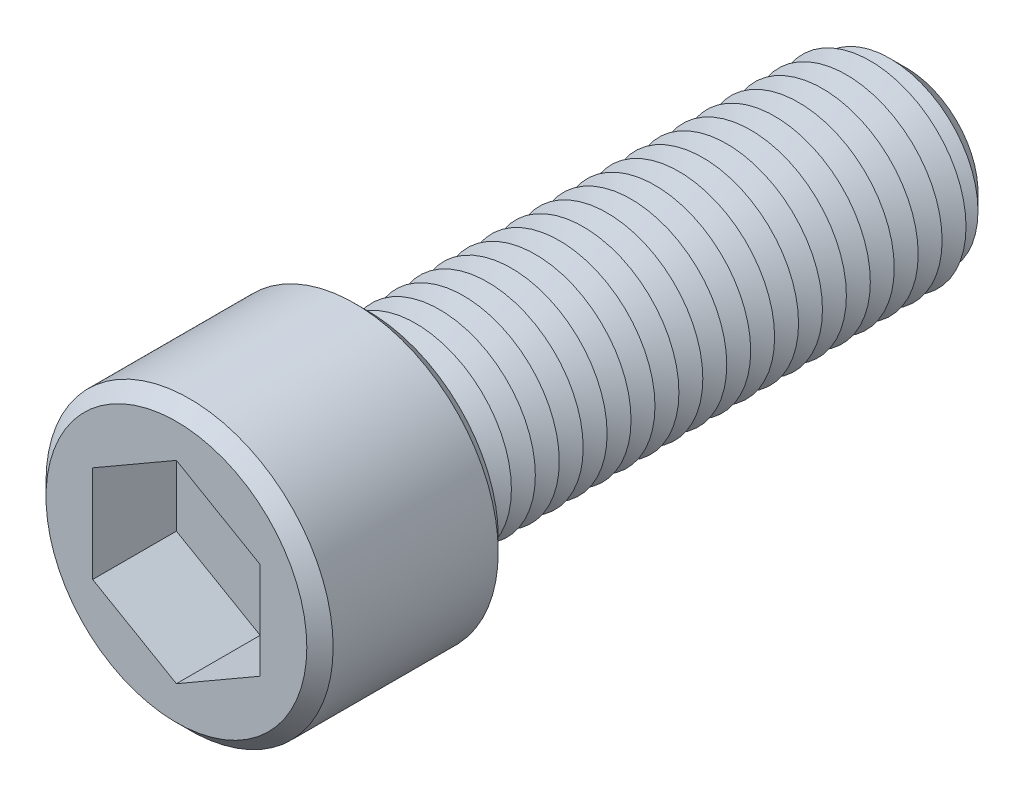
ISO-10303-21;
HEADER;
FILE_DESCRIPTION(('STEP AP214'),'2;1');
FILE_NAME('part.step','',(''),(''),'','','');
FILE_SCHEMA(('AUTOMOTIVE_DESIGN { 1 0 10303 214 1 1 1 1 }'));
ENDSEC;
DATA;
#1=APPLICATION_CONTEXT('core data for automotive mechanical design processes');
#2=APPLICATION_PROTOCOL_DEFINITION('international standard','automotive_design',2000,#1);
#3=PRODUCT_CONTEXT('',#1,'mechanical');
#4=PRODUCT('Part','Part','',(#3));
#5=PRODUCT_RELATED_PRODUCT_CATEGORY('part','',(#4));
#6=PRODUCT_DEFINITION_FORMATION('','',#4);
#7=PRODUCT_DEFINITION_CONTEXT('part definition',#1,'design');
#8=PRODUCT_DEFINITION('design','',#6,#7);
#9=PRODUCT_DEFINITION_SHAPE('','',#8);
#10=(LENGTH_UNIT() NAMED_UNIT(*) SI_UNIT(.MILLI.,.METRE.));
#11=(NAMED_UNIT(*) PLANE_ANGLE_UNIT() SI_UNIT($,.RADIAN.));
#12=(NAMED_UNIT(*) SI_UNIT($,.STERADIAN.) SOLID_ANGLE_UNIT());
#13=UNCERTAINTY_MEASURE_WITH_UNIT(LENGTH_MEASURE(1.E-05),#10,'distance_accuracy_value','');
#14=(GEOMETRIC_REPRESENTATION_CONTEXT(3) GLOBAL_UNCERTAINTY_ASSIGNED_CONTEXT((#13)) GLOBAL_UNIT_ASSIGNED_CONTEXT((#10,
#11,#12)) REPRESENTATION_CONTEXT('',''));
#15=CARTESIAN_POINT('',(0.,0.,0.));
#16=DIRECTION('',(0.,0.,1.));
#17=DIRECTION('',(1.,0.,0.));
#18=AXIS2_PLACEMENT_3D('',#15,#16,#17);
#19=CARTESIAN_POINT('',(0.,0.,16.));
#20=DIRECTION('',(0.,0.,-1.));
#21=DIRECTION('',(-1.,0.,0.));
#22=AXIS2_PLACEMENT_3D('',#19,#20,#21);
#23=CYLINDRICAL_SURFACE('',#22,12.);
#24=CARTESIAN_POINT('',(0.,0.,1.10000000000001));
#25=DIRECTION('',(0.,0.,1.));
#26=DIRECTION('',(1.,0.,0.));
#27=AXIS2_PLACEMENT_3D('',#24,#25,#26);
#28=CIRCLE('',#27,12.);
#29=CARTESIAN_POINT('',(12.,0.,1.10000000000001));
#30=VERTEX_POINT('',#29);
#31=EDGE_CURVE('E352',#30,#30,#28,.T.);
#32=ORIENTED_EDGE('',*,*,#31,.T.);
#33=EDGE_LOOP('',(#32));
#34=FACE_BOUND('',#33,.T.);
#35=CARTESIAN_POINT('',(0.,0.,14.9));
#36=DIRECTION('',(0.,0.,1.));
#37=DIRECTION('',(1.,0.,0.));
#38=AXIS2_PLACEMENT_3D('',#35,#36,#37);
#39=CIRCLE('',#38,12.);
#40=CARTESIAN_POINT('',(12.,0.,14.9));
#41=VERTEX_POINT('',#40);
#42=EDGE_CURVE('E345',#41,#41,#39,.F.);
#43=ORIENTED_EDGE('',*,*,#42,.T.);
#44=EDGE_LOOP('',(#43));
#45=FACE_BOUND('',#44,.T.);
#46=ADVANCED_FACE('F39',(#34,#45),#23,.T.);
#47=CARTESIAN_POINT('',(0.,0.,16.));
#48=DIRECTION('',(0.,0.,1.));
#49=DIRECTION('',(1.,0.,0.));
#50=AXIS2_PLACEMENT_3D('',#47,#48,#49);
#51=PLANE('',#50);
#52=CARTESIAN_POINT('',(0.,0.,16.));
#53=DIRECTION('',(0.,0.,1.));
#54=DIRECTION('',(1.,0.,0.));
#55=AXIS2_PLACEMENT_3D('',#52,#53,#54);
#56=CIRCLE('',#55,10.9);
#57=CARTESIAN_POINT('',(10.9,0.,16.));
#58=VERTEX_POINT('',#57);
#59=EDGE_CURVE('E11',#58,#58,#56,.T.);
#60=ORIENTED_EDGE('',*,*,#59,.T.);
#61=EDGE_LOOP('',(#60));
#62=FACE_BOUND('',#61,.T.);
#63=DIRECTION('',(-0.866025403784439,0.5,0.));
#64=VECTOR('',#63,1.);
#65=CARTESIAN_POINT('',(7.,4.04145188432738,16.));
#66=LINE('',#65,#64);
#67=CARTESIAN_POINT('',(7.,4.04145188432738,16.));
#68=VERTEX_POINT('',#67);
#69=CARTESIAN_POINT('',(0.,8.08290376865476,16.));
#70=VERTEX_POINT('',#69);
#71=EDGE_CURVE('E55',#68,#70,#66,.T.);
#72=ORIENTED_EDGE('',*,*,#71,.F.);
#73=DIRECTION('',(0.,1.,0.));
#74=VECTOR('',#73,1.);
#75=CARTESIAN_POINT('',(7.,-4.04145188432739,16.));
#76=LINE('',#75,#74);
#77=CARTESIAN_POINT('',(7.,-4.04145188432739,16.));
#78=VERTEX_POINT('',#77);
#79=EDGE_CURVE('E151',#78,#68,#76,.T.);
#80=ORIENTED_EDGE('',*,*,#79,.F.);
#81=DIRECTION('',(0.866025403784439,0.5,0.));
#82=VECTOR('',#81,1.);
#83=CARTESIAN_POINT('',(0.,-8.08290376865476,16.));
#84=LINE('',#83,#82);
#85=CARTESIAN_POINT('',(0.,-8.08290376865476,16.));
#86=VERTEX_POINT('',#85);
#87=EDGE_CURVE('E148',#86,#78,#84,.T.);
#88=ORIENTED_EDGE('',*,*,#87,.F.);
#89=DIRECTION('',(0.866025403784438,-0.5,0.));
#90=VECTOR('',#89,1.);
#91=CARTESIAN_POINT('',(-7.,-4.04145188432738,16.));
#92=LINE('',#91,#90);
#93=CARTESIAN_POINT('',(-7.,-4.04145188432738,16.));
#94=VERTEX_POINT('',#93);
#95=EDGE_CURVE('E103',#94,#86,#92,.T.);
#96=ORIENTED_EDGE('',*,*,#95,.F.);
#97=DIRECTION('',(0.,-1.,0.));
#98=VECTOR('',#97,1.);
#99=CARTESIAN_POINT('',(-7.,4.04145188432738,16.));
#100=LINE('',#99,#98);
#101=CARTESIAN_POINT('',(-7.,4.04145188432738,16.));
#102=VERTEX_POINT('',#101);
#103=EDGE_CURVE('E142',#102,#94,#100,.T.);
#104=ORIENTED_EDGE('',*,*,#103,.F.);
#105=DIRECTION('',(-0.866025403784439,-0.5,0.));
#106=VECTOR('',#105,1.);
#107=CARTESIAN_POINT('',(0.,8.08290376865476,16.));
#108=LINE('',#107,#106);
#109=EDGE_CURVE('E137',#70,#102,#108,.T.);
#110=ORIENTED_EDGE('',*,*,#109,.F.);
#111=EDGE_LOOP('',(#72,#80,#88,#96,#104,#110));
#112=FACE_BOUND('',#111,.T.);
#113=ADVANCED_FACE('F370',(#62,#112),#51,.T.);
#114=CARTESIAN_POINT('',(0.,0.,0.));
#115=DIRECTION('',(0.,0.,1.));
#116=DIRECTION('',(1.,0.,0.));
#117=AXIS2_PLACEMENT_3D('',#114,#115,#116);
#118=PLANE('',#117);
#119=CARTESIAN_POINT('',(0.,0.,0.));
#120=DIRECTION('',(0.,0.,1.));
#121=DIRECTION('',(1.,0.,0.));
#122=AXIS2_PLACEMENT_3D('',#119,#120,#121);
#123=CIRCLE('',#122,10.9);
#124=CARTESIAN_POINT('',(10.9,0.,0.));
#125=VERTEX_POINT('',#124);
#126=EDGE_CURVE('E48',#125,#125,#123,.F.);
#127=ORIENTED_EDGE('',*,*,#126,.T.);
#128=EDGE_LOOP('',(#127));
#129=FACE_BOUND('',#128,.T.);
#130=CARTESIAN_POINT('',(0.,0.,0.));
#131=DIRECTION('',(0.,0.,1.));
#132=DIRECTION('',(1.,0.,0.));
#133=AXIS2_PLACEMENT_3D('',#130,#131,#132);
#134=CIRCLE('',#133,8.);
#135=CARTESIAN_POINT('',(8.,0.,0.));
#136=VERTEX_POINT('',#135);
#137=EDGE_CURVE('E337',#136,#136,#134,.T.);
#138=ORIENTED_EDGE('',*,*,#137,.T.);
#139=EDGE_LOOP('',(#138));
#140=FACE_BOUND('',#139,.T.);
#141=ADVANCED_FACE('F359',(#129,#140),#118,.F.);
#142=CARTESIAN_POINT('',(0.,0.,0.));
#143=DIRECTION('',(0.,0.,1.));
#144=DIRECTION('',(1.,0.,0.));
#145=AXIS2_PLACEMENT_3D('',#142,#143,#144);
#146=CONICAL_SURFACE('',#145,8.,1.0471975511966);
#147=CARTESIAN_POINT('',(0.,0.,-1.));
#148=DIRECTION('',(0.,0.,1.));
#149=DIRECTION('',(1.,0.,0.));
#150=AXIS2_PLACEMENT_3D('',#147,#148,#149);
#151=CIRCLE('',#150,6.26794919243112);
#152=CARTESIAN_POINT('',(6.26794919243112,0.,-1.));
#153=VERTEX_POINT('',#152);
#154=EDGE_CURVE('E333',#153,#153,#151,.T.);
#155=ORIENTED_EDGE('',*,*,#154,.T.);
#156=EDGE_LOOP('',(#155));
#157=FACE_BOUND('',#156,.T.);
#158=ORIENTED_EDGE('',*,*,#137,.F.);
#159=EDGE_LOOP('',(#158));
#160=FACE_BOUND('',#159,.T.);
#161=ADVANCED_FACE('F596',(#157,#160),#146,.T.);
#162=CARTESIAN_POINT('',(0.,0.,-1.));
#163=DIRECTION('',(0.,0.,-1.));
#164=DIRECTION('',(-1.,0.,0.));
#165=AXIS2_PLACEMENT_3D('',#162,#163,#164);
#166=CONICAL_SURFACE('',#165,6.26794919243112,1.0471975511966);
#167=CARTESIAN_POINT('',(0.,0.,-2.));
#168=DIRECTION('',(0.,0.,1.));
#169=DIRECTION('',(1.,0.,0.));
#170=AXIS2_PLACEMENT_3D('',#167,#168,#169);
#171=CIRCLE('',#170,8.);
#172=CARTESIAN_POINT('',(8.,0.,-2.));
#173=VERTEX_POINT('',#172);
#174=EDGE_CURVE('E329',#173,#173,#171,.T.);
#175=ORIENTED_EDGE('',*,*,#174,.T.);
#176=EDGE_LOOP('',(#175));
#177=FACE_BOUND('',#176,.T.);
#178=ORIENTED_EDGE('',*,*,#154,.F.);
#179=EDGE_LOOP('',(#178));
#180=FACE_BOUND('',#179,.T.);
#181=ADVANCED_FACE('F592',(#177,#180),#166,.T.);
#182=CARTESIAN_POINT('',(0.,0.,-2.));
#183=DIRECTION('',(0.,0.,1.));
#184=DIRECTION('',(1.,0.,0.));
#185=AXIS2_PLACEMENT_3D('',#182,#183,#184);
#186=CONICAL_SURFACE('',#185,8.,1.0471975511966);
#187=CARTESIAN_POINT('',(0.,0.,-3.));
#188=DIRECTION('',(0.,0.,1.));
#189=DIRECTION('',(1.,0.,0.));
#190=AXIS2_PLACEMENT_3D('',#187,#188,#189);
#191=CIRCLE('',#190,6.26794919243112);
#192=CARTESIAN_POINT('',(6.26794919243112,0.,-3.));
#193=VERTEX_POINT('',#192);
#194=EDGE_CURVE('E325',#193,#193,#191,.T.);
#195=ORIENTED_EDGE('',*,*,#194,.T.);
#196=EDGE_LOOP('',(#195));
#197=FACE_BOUND('',#196,.T.);
#198=ORIENTED_EDGE('',*,*,#174,.F.);
#199=EDGE_LOOP('',(#198));
#200=FACE_BOUND('',#199,.T.);
#201=ADVANCED_FACE('F588',(#197,#200),#186,.T.);
#202=CARTESIAN_POINT('',(0.,0.,-3.));
#203=DIRECTION('',(0.,0.,-1.));
#204=DIRECTION('',(-1.,0.,0.));
#205=AXIS2_PLACEMENT_3D('',#202,#203,#204);
#206=CONICAL_SURFACE('',#205,6.26794919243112,1.0471975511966);
#207=CARTESIAN_POINT('',(0.,0.,-4.));
#208=DIRECTION('',(0.,0.,1.));
#209=DIRECTION('',(1.,0.,0.));
#210=AXIS2_PLACEMENT_3D('',#207,#208,#209);
#211=CIRCLE('',#210,8.);
#212=CARTESIAN_POINT('',(8.,0.,-4.));
#213=VERTEX_POINT('',#212);
#214=EDGE_CURVE('E322',#213,#213,#211,.T.);
#215=ORIENTED_EDGE('',*,*,#214,.T.);
#216=EDGE_LOOP('',(#215));
#217=FACE_BOUND('',#216,.T.);
#218=ORIENTED_EDGE('',*,*,#194,.F.);
#219=EDGE_LOOP('',(#218));
#220=FACE_BOUND('',#219,.T.);
#221=ADVANCED_FACE('F584',(#217,#220),#206,.T.);
#222=CARTESIAN_POINT('',(0.,0.,-4.));
#223=DIRECTION('',(0.,0.,1.));
#224=DIRECTION('',(1.,0.,0.));
#225=AXIS2_PLACEMENT_3D('',#222,#223,#224);
#226=CONICAL_SURFACE('',#225,8.,1.0471975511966);
#227=CARTESIAN_POINT('',(0.,0.,-5.));
#228=DIRECTION('',(0.,0.,1.));
#229=DIRECTION('',(1.,0.,0.));
#230=AXIS2_PLACEMENT_3D('',#227,#228,#229);
#231=CIRCLE('',#230,6.26794919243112);
#232=CARTESIAN_POINT('',(6.26794919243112,0.,-5.));
#233=VERTEX_POINT('',#232);
#234=EDGE_CURVE('E318',#233,#233,#231,.T.);
#235=ORIENTED_EDGE('',*,*,#234,.T.);
#236=EDGE_LOOP('',(#235));
#237=FACE_BOUND('',#236,.T.);
#238=ORIENTED_EDGE('',*,*,#214,.F.);
#239=EDGE_LOOP('',(#238));
#240=FACE_BOUND('',#239,.T.);
#241=ADVANCED_FACE('F580',(#237,#240),#226,.T.);
#242=CARTESIAN_POINT('',(0.,0.,-5.));
#243=DIRECTION('',(0.,0.,-1.));
#244=DIRECTION('',(-1.,0.,0.));
#245=AXIS2_PLACEMENT_3D('',#242,#243,#244);
#246=CONICAL_SURFACE('',#245,6.26794919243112,1.0471975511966);
#247=CARTESIAN_POINT('',(0.,0.,-6.));
#248=DIRECTION('',(0.,0.,1.));
#249=DIRECTION('',(1.,0.,0.));
#250=AXIS2_PLACEMENT_3D('',#247,#248,#249);
#251=CIRCLE('',#250,8.);
#252=CARTESIAN_POINT('',(8.,0.,-6.));
#253=VERTEX_POINT('',#252);
#254=EDGE_CURVE('E314',#253,#253,#251,.T.);
#255=ORIENTED_EDGE('',*,*,#254,.T.);
#256=EDGE_LOOP('',(#255));
#257=FACE_BOUND('',#256,.T.);
#258=ORIENTED_EDGE('',*,*,#234,.F.);
#259=EDGE_LOOP('',(#258));
#260=FACE_BOUND('',#259,.T.);
#261=ADVANCED_FACE('F576',(#257,#260),#246,.T.);
#262=CARTESIAN_POINT('',(0.,0.,-6.));
#263=DIRECTION('',(0.,0.,1.));
#264=DIRECTION('',(1.,0.,0.));
#265=AXIS2_PLACEMENT_3D('',#262,#263,#264);
#266=CONICAL_SURFACE('',#265,8.,1.0471975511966);
#267=CARTESIAN_POINT('',(0.,0.,-7.));
#268=DIRECTION('',(0.,0.,1.));
#269=DIRECTION('',(1.,0.,0.));
#270=AXIS2_PLACEMENT_3D('',#267,#268,#269);
#271=CIRCLE('',#270,6.26794919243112);
#272=CARTESIAN_POINT('',(6.26794919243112,0.,-7.));
#273=VERTEX_POINT('',#272);
#274=EDGE_CURVE('E310',#273,#273,#271,.T.);
#275=ORIENTED_EDGE('',*,*,#274,.T.);
#276=EDGE_LOOP('',(#275));
#277=FACE_BOUND('',#276,.T.);
#278=ORIENTED_EDGE('',*,*,#254,.F.);
#279=EDGE_LOOP('',(#278));
#280=FACE_BOUND('',#279,.T.);
#281=ADVANCED_FACE('F572',(#277,#280),#266,.T.);
#282=CARTESIAN_POINT('',(0.,0.,-7.));
#283=DIRECTION('',(0.,0.,-1.));
#284=DIRECTION('',(-1.,0.,0.));
#285=AXIS2_PLACEMENT_3D('',#282,#283,#284);
#286=CONICAL_SURFACE('',#285,6.26794919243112,1.0471975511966);
#287=CARTESIAN_POINT('',(0.,0.,-8.));
#288=DIRECTION('',(0.,0.,1.));
#289=DIRECTION('',(1.,0.,0.));
#290=AXIS2_PLACEMENT_3D('',#287,#288,#289);
#291=CIRCLE('',#290,8.);
#292=CARTESIAN_POINT('',(8.,0.,-8.));
#293=VERTEX_POINT('',#292);
#294=EDGE_CURVE('E306',#293,#293,#291,.T.);
#295=ORIENTED_EDGE('',*,*,#294,.T.);
#296=EDGE_LOOP('',(#295));
#297=FACE_BOUND('',#296,.T.);
#298=ORIENTED_EDGE('',*,*,#274,.F.);
#299=EDGE_LOOP('',(#298));
#300=FACE_BOUND('',#299,.T.);
#301=ADVANCED_FACE('F568',(#297,#300),#286,.T.);
#302=CARTESIAN_POINT('',(0.,0.,-8.));
#303=DIRECTION('',(0.,0.,1.));
#304=DIRECTION('',(1.,0.,0.));
#305=AXIS2_PLACEMENT_3D('',#302,#303,#304);
#306=CONICAL_SURFACE('',#305,8.,1.0471975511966);
#307=CARTESIAN_POINT('',(0.,0.,-9.));
#308=DIRECTION('',(0.,0.,1.));
#309=DIRECTION('',(1.,0.,0.));
#310=AXIS2_PLACEMENT_3D('',#307,#308,#309);
#311=CIRCLE('',#310,6.26794919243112);
#312=CARTESIAN_POINT('',(6.26794919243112,0.,-9.));
#313=VERTEX_POINT('',#312);
#314=EDGE_CURVE('E302',#313,#313,#311,.T.);
#315=ORIENTED_EDGE('',*,*,#314,.T.);
#316=EDGE_LOOP('',(#315));
#317=FACE_BOUND('',#316,.T.);
#318=ORIENTED_EDGE('',*,*,#294,.F.);
#319=EDGE_LOOP('',(#318));
#320=FACE_BOUND('',#319,.T.);
#321=ADVANCED_FACE('F564',(#317,#320),#306,.T.);
#322=CARTESIAN_POINT('',(0.,0.,-9.));
#323=DIRECTION('',(0.,0.,-1.));
#324=DIRECTION('',(-1.,0.,0.));
#325=AXIS2_PLACEMENT_3D('',#322,#323,#324);
#326=CONICAL_SURFACE('',#325,6.26794919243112,1.0471975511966);
#327=CARTESIAN_POINT('',(0.,0.,-10.));
#328=DIRECTION('',(0.,0.,1.));
#329=DIRECTION('',(1.,0.,0.));
#330=AXIS2_PLACEMENT_3D('',#327,#328,#329);
#331=CIRCLE('',#330,8.);
#332=CARTESIAN_POINT('',(8.,0.,-10.));
#333=VERTEX_POINT('',#332);
#334=EDGE_CURVE('E298',#333,#333,#331,.T.);
#335=ORIENTED_EDGE('',*,*,#334,.T.);
#336=EDGE_LOOP('',(#335));
#337=FACE_BOUND('',#336,.T.);
#338=ORIENTED_EDGE('',*,*,#314,.F.);
#339=EDGE_LOOP('',(#338));
#340=FACE_BOUND('',#339,.T.);
#341=ADVANCED_FACE('F560',(#337,#340),#326,.T.);
#342=CARTESIAN_POINT('',(0.,0.,-10.));
#343=DIRECTION('',(0.,0.,1.));
#344=DIRECTION('',(1.,0.,0.));
#345=AXIS2_PLACEMENT_3D('',#342,#343,#344);
#346=CONICAL_SURFACE('',#345,8.,1.0471975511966);
#347=CARTESIAN_POINT('',(0.,0.,-11.));
#348=DIRECTION('',(0.,0.,1.));
#349=DIRECTION('',(1.,0.,0.));
#350=AXIS2_PLACEMENT_3D('',#347,#348,#349);
#351=CIRCLE('',#350,6.26794919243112);
#352=CARTESIAN_POINT('',(6.26794919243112,0.,-11.));
#353=VERTEX_POINT('',#352);
#354=EDGE_CURVE('E294',#353,#353,#351,.T.);
#355=ORIENTED_EDGE('',*,*,#354,.T.);
#356=EDGE_LOOP('',(#355));
#357=FACE_BOUND('',#356,.T.);
#358=ORIENTED_EDGE('',*,*,#334,.F.);
#359=EDGE_LOOP('',(#358));
#360=FACE_BOUND('',#359,.T.);
#361=ADVANCED_FACE('F556',(#357,#360),#346,.T.);
#362=CARTESIAN_POINT('',(0.,0.,-11.));
#363=DIRECTION('',(0.,0.,-1.));
#364=DIRECTION('',(-1.,0.,0.));
#365=AXIS2_PLACEMENT_3D('',#362,#363,#364);
#366=CONICAL_SURFACE('',#365,6.26794919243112,1.0471975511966);
#367=CARTESIAN_POINT('',(0.,0.,-12.));
#368=DIRECTION('',(0.,0.,1.));
#369=DIRECTION('',(1.,0.,0.));
#370=AXIS2_PLACEMENT_3D('',#367,#368,#369);
#371=CIRCLE('',#370,8.);
#372=CARTESIAN_POINT('',(8.,0.,-12.));
#373=VERTEX_POINT('',#372);
#374=EDGE_CURVE('E290',#373,#373,#371,.T.);
#375=ORIENTED_EDGE('',*,*,#374,.T.);
#376=EDGE_LOOP('',(#375));
#377=FACE_BOUND('',#376,.T.);
#378=ORIENTED_EDGE('',*,*,#354,.F.);
#379=EDGE_LOOP('',(#378));
#380=FACE_BOUND('',#379,.T.);
#381=ADVANCED_FACE('F552',(#377,#380),#366,.T.);
#382=CARTESIAN_POINT('',(0.,0.,-12.));
#383=DIRECTION('',(0.,0.,1.));
#384=DIRECTION('',(1.,0.,0.));
#385=AXIS2_PLACEMENT_3D('',#382,#383,#384);
#386=CONICAL_SURFACE('',#385,8.,1.0471975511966);
#387=CARTESIAN_POINT('',(0.,0.,-13.));
#388=DIRECTION('',(0.,0.,1.));
#389=DIRECTION('',(1.,0.,0.));
#390=AXIS2_PLACEMENT_3D('',#387,#388,#389);
#391=CIRCLE('',#390,6.26794919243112);
#392=CARTESIAN_POINT('',(6.26794919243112,0.,-13.));
#393=VERTEX_POINT('',#392);
#394=EDGE_CURVE('E286',#393,#393,#391,.T.);
#395=ORIENTED_EDGE('',*,*,#394,.T.);
#396=EDGE_LOOP('',(#395));
#397=FACE_BOUND('',#396,.T.);
#398=ORIENTED_EDGE('',*,*,#374,.F.);
#399=EDGE_LOOP('',(#398));
#400=FACE_BOUND('',#399,.T.);
#401=ADVANCED_FACE('F548',(#397,#400),#386,.T.);
#402=CARTESIAN_POINT('',(0.,0.,-13.));
#403=DIRECTION('',(0.,0.,-1.));
#404=DIRECTION('',(-1.,0.,0.));
#405=AXIS2_PLACEMENT_3D('',#402,#403,#404);
#406=CONICAL_SURFACE('',#405,6.26794919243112,1.0471975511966);
#407=CARTESIAN_POINT('',(0.,0.,-14.));
#408=DIRECTION('',(0.,0.,1.));
#409=DIRECTION('',(1.,0.,0.));
#410=AXIS2_PLACEMENT_3D('',#407,#408,#409);
#411=CIRCLE('',#410,8.);
#412=CARTESIAN_POINT('',(8.,0.,-14.));
#413=VERTEX_POINT('',#412);
#414=EDGE_CURVE('E282',#413,#413,#411,.T.);
#415=ORIENTED_EDGE('',*,*,#414,.T.);
#416=EDGE_LOOP('',(#415));
#417=FACE_BOUND('',#416,.T.);
#418=ORIENTED_EDGE('',*,*,#394,.F.);
#419=EDGE_LOOP('',(#418));
#420=FACE_BOUND('',#419,.T.);
#421=ADVANCED_FACE('F544',(#417,#420),#406,.T.);
#422=CARTESIAN_POINT('',(0.,0.,-14.));
#423=DIRECTION('',(0.,0.,1.));
#424=DIRECTION('',(1.,0.,0.));
#425=AXIS2_PLACEMENT_3D('',#422,#423,#424);
#426=CONICAL_SURFACE('',#425,8.,1.0471975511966);
#427=CARTESIAN_POINT('',(0.,0.,-15.));
#428=DIRECTION('',(0.,0.,1.));
#429=DIRECTION('',(1.,0.,0.));
#430=AXIS2_PLACEMENT_3D('',#427,#428,#429);
#431=CIRCLE('',#430,6.26794919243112);
#432=CARTESIAN_POINT('',(6.26794919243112,0.,-15.));
#433=VERTEX_POINT('',#432);
#434=EDGE_CURVE('E278',#433,#433,#431,.T.);
#435=ORIENTED_EDGE('',*,*,#434,.T.);
#436=EDGE_LOOP('',(#435));
#437=FACE_BOUND('',#436,.T.);
#438=ORIENTED_EDGE('',*,*,#414,.F.);
#439=EDGE_LOOP('',(#438));
#440=FACE_BOUND('',#439,.T.);
#441=ADVANCED_FACE('F540',(#437,#440),#426,.T.);
#442=CARTESIAN_POINT('',(0.,0.,-15.));
#443=DIRECTION('',(0.,0.,-1.));
#444=DIRECTION('',(-1.,0.,0.));
#445=AXIS2_PLACEMENT_3D('',#442,#443,#444);
#446=CONICAL_SURFACE('',#445,6.26794919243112,1.0471975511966);
#447=CARTESIAN_POINT('',(0.,0.,-16.));
#448=DIRECTION('',(0.,0.,1.));
#449=DIRECTION('',(1.,0.,0.));
#450=AXIS2_PLACEMENT_3D('',#447,#448,#449);
#451=CIRCLE('',#450,8.);
#452=CARTESIAN_POINT('',(8.,0.,-16.));
#453=VERTEX_POINT('',#452);
#454=EDGE_CURVE('E274',#453,#453,#451,.T.);
#455=ORIENTED_EDGE('',*,*,#454,.T.);
#456=EDGE_LOOP('',(#455));
#457=FACE_BOUND('',#456,.T.);
#458=ORIENTED_EDGE('',*,*,#434,.F.);
#459=EDGE_LOOP('',(#458));
#460=FACE_BOUND('',#459,.T.);
#461=ADVANCED_FACE('F536',(#457,#460),#446,.T.);
#462=CARTESIAN_POINT('',(0.,0.,-16.));
#463=DIRECTION('',(0.,0.,1.));
#464=DIRECTION('',(1.,0.,0.));
#465=AXIS2_PLACEMENT_3D('',#462,#463,#464);
#466=CONICAL_SURFACE('',#465,8.,1.0471975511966);
#467=CARTESIAN_POINT('',(0.,0.,-17.));
#468=DIRECTION('',(0.,0.,1.));
#469=DIRECTION('',(1.,0.,0.));
#470=AXIS2_PLACEMENT_3D('',#467,#468,#469);
#471=CIRCLE('',#470,6.26794919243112);
#472=CARTESIAN_POINT('',(6.26794919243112,0.,-17.));
#473=VERTEX_POINT('',#472);
#474=EDGE_CURVE('E270',#473,#473,#471,.T.);
#475=ORIENTED_EDGE('',*,*,#474,.T.);
#476=EDGE_LOOP('',(#475));
#477=FACE_BOUND('',#476,.T.);
#478=ORIENTED_EDGE('',*,*,#454,.F.);
#479=EDGE_LOOP('',(#478));
#480=FACE_BOUND('',#479,.T.);
#481=ADVANCED_FACE('F532',(#477,#480),#466,.T.);
#482=CARTESIAN_POINT('',(0.,0.,-17.));
#483=DIRECTION('',(0.,0.,-1.));
#484=DIRECTION('',(-1.,0.,0.));
#485=AXIS2_PLACEMENT_3D('',#482,#483,#484);
#486=CONICAL_SURFACE('',#485,6.26794919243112,1.0471975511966);
#487=CARTESIAN_POINT('',(0.,0.,-18.));
#488=DIRECTION('',(0.,0.,1.));
#489=DIRECTION('',(1.,0.,0.));
#490=AXIS2_PLACEMENT_3D('',#487,#488,#489);
#491=CIRCLE('',#490,8.);
#492=CARTESIAN_POINT('',(8.,0.,-18.));
#493=VERTEX_POINT('',#492);
#494=EDGE_CURVE('E266',#493,#493,#491,.T.);
#495=ORIENTED_EDGE('',*,*,#494,.T.);
#496=EDGE_LOOP('',(#495));
#497=FACE_BOUND('',#496,.T.);
#498=ORIENTED_EDGE('',*,*,#474,.F.);
#499=EDGE_LOOP('',(#498));
#500=FACE_BOUND('',#499,.T.);
#501=ADVANCED_FACE('F528',(#497,#500),#486,.T.);
#502=CARTESIAN_POINT('',(0.,0.,-18.));
#503=DIRECTION('',(0.,0.,1.));
#504=DIRECTION('',(1.,0.,0.));
#505=AXIS2_PLACEMENT_3D('',#502,#503,#504);
#506=CONICAL_SURFACE('',#505,8.,1.0471975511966);
#507=CARTESIAN_POINT('',(0.,0.,-19.));
#508=DIRECTION('',(0.,0.,1.));
#509=DIRECTION('',(1.,0.,0.));
#510=AXIS2_PLACEMENT_3D('',#507,#508,#509);
#511=CIRCLE('',#510,6.26794919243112);
#512=CARTESIAN_POINT('',(6.26794919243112,0.,-19.));
#513=VERTEX_POINT('',#512);
#514=EDGE_CURVE('E262',#513,#513,#511,.T.);
#515=ORIENTED_EDGE('',*,*,#514,.T.);
#516=EDGE_LOOP('',(#515));
#517=FACE_BOUND('',#516,.T.);
#518=ORIENTED_EDGE('',*,*,#494,.F.);
#519=EDGE_LOOP('',(#518));
#520=FACE_BOUND('',#519,.T.);
#521=ADVANCED_FACE('F524',(#517,#520),#506,.T.);
#522=CARTESIAN_POINT('',(0.,0.,-19.));
#523=DIRECTION('',(0.,0.,-1.));
#524=DIRECTION('',(-1.,0.,0.));
#525=AXIS2_PLACEMENT_3D('',#522,#523,#524);
#526=CONICAL_SURFACE('',#525,6.26794919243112,1.0471975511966);
#527=CARTESIAN_POINT('',(0.,0.,-20.));
#528=DIRECTION('',(0.,0.,1.));
#529=DIRECTION('',(1.,0.,0.));
#530=AXIS2_PLACEMENT_3D('',#527,#528,#529);
#531=CIRCLE('',#530,8.);
#532=CARTESIAN_POINT('',(8.,0.,-20.));
#533=VERTEX_POINT('',#532);
#534=EDGE_CURVE('E258',#533,#533,#531,.T.);
#535=ORIENTED_EDGE('',*,*,#534,.T.);
#536=EDGE_LOOP('',(#535));
#537=FACE_BOUND('',#536,.T.);
#538=ORIENTED_EDGE('',*,*,#514,.F.);
#539=EDGE_LOOP('',(#538));
#540=FACE_BOUND('',#539,.T.);
#541=ADVANCED_FACE('F520',(#537,#540),#526,.T.);
#542=CARTESIAN_POINT('',(0.,0.,-20.));
#543=DIRECTION('',(0.,0.,1.));
#544=DIRECTION('',(1.,0.,0.));
#545=AXIS2_PLACEMENT_3D('',#542,#543,#544);
#546=CONICAL_SURFACE('',#545,8.,1.0471975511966);
#547=CARTESIAN_POINT('',(0.,0.,-21.));
#548=DIRECTION('',(0.,0.,1.));
#549=DIRECTION('',(1.,0.,0.));
#550=AXIS2_PLACEMENT_3D('',#547,#548,#549);
#551=CIRCLE('',#550,6.26794919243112);
#552=CARTESIAN_POINT('',(6.26794919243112,0.,-21.));
#553=VERTEX_POINT('',#552);
#554=EDGE_CURVE('E254',#553,#553,#551,.T.);
#555=ORIENTED_EDGE('',*,*,#554,.T.);
#556=EDGE_LOOP('',(#555));
#557=FACE_BOUND('',#556,.T.);
#558=ORIENTED_EDGE('',*,*,#534,.F.);
#559=EDGE_LOOP('',(#558));
#560=FACE_BOUND('',#559,.T.);
#561=ADVANCED_FACE('F516',(#557,#560),#546,.T.);
#562=CARTESIAN_POINT('',(0.,0.,-21.));
#563=DIRECTION('',(0.,0.,-1.));
#564=DIRECTION('',(-1.,0.,0.));
#565=AXIS2_PLACEMENT_3D('',#562,#563,#564);
#566=CONICAL_SURFACE('',#565,6.26794919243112,1.0471975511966);
#567=CARTESIAN_POINT('',(0.,0.,-22.));
#568=DIRECTION('',(0.,0.,1.));
#569=DIRECTION('',(1.,0.,0.));
#570=AXIS2_PLACEMENT_3D('',#567,#568,#569);
#571=CIRCLE('',#570,8.);
#572=CARTESIAN_POINT('',(8.,0.,-22.));
#573=VERTEX_POINT('',#572);
#574=EDGE_CURVE('E250',#573,#573,#571,.T.);
#575=ORIENTED_EDGE('',*,*,#574,.T.);
#576=EDGE_LOOP('',(#575));
#577=FACE_BOUND('',#576,.T.);
#578=ORIENTED_EDGE('',*,*,#554,.F.);
#579=EDGE_LOOP('',(#578));
#580=FACE_BOUND('',#579,.T.);
#581=ADVANCED_FACE('F512',(#577,#580),#566,.T.);
#582=CARTESIAN_POINT('',(0.,0.,-22.));
#583=DIRECTION('',(0.,0.,1.));
#584=DIRECTION('',(1.,0.,0.));
#585=AXIS2_PLACEMENT_3D('',#582,#583,#584);
#586=CONICAL_SURFACE('',#585,8.,1.0471975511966);
#587=CARTESIAN_POINT('',(0.,0.,-23.));
#588=DIRECTION('',(0.,0.,1.));
#589=DIRECTION('',(1.,0.,0.));
#590=AXIS2_PLACEMENT_3D('',#587,#588,#589);
#591=CIRCLE('',#590,6.26794919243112);
#592=CARTESIAN_POINT('',(6.26794919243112,0.,-23.));
#593=VERTEX_POINT('',#592);
#594=EDGE_CURVE('E246',#593,#593,#591,.T.);
#595=ORIENTED_EDGE('',*,*,#594,.T.);
#596=EDGE_LOOP('',(#595));
#597=FACE_BOUND('',#596,.T.);
#598=ORIENTED_EDGE('',*,*,#574,.F.);
#599=EDGE_LOOP('',(#598));
#600=FACE_BOUND('',#599,.T.);
#601=ADVANCED_FACE('F508',(#597,#600),#586,.T.);
#602=CARTESIAN_POINT('',(0.,0.,-23.));
#603=DIRECTION('',(0.,0.,-1.));
#604=DIRECTION('',(-1.,0.,0.));
#605=AXIS2_PLACEMENT_3D('',#602,#603,#604);
#606=CONICAL_SURFACE('',#605,6.26794919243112,1.0471975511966);
#607=CARTESIAN_POINT('',(0.,0.,-24.));
#608=DIRECTION('',(0.,0.,1.));
#609=DIRECTION('',(1.,0.,0.));
#610=AXIS2_PLACEMENT_3D('',#607,#608,#609);
#611=CIRCLE('',#610,8.);
#612=CARTESIAN_POINT('',(8.,0.,-24.));
#613=VERTEX_POINT('',#612);
#614=EDGE_CURVE('E242',#613,#613,#611,.T.);
#615=ORIENTED_EDGE('',*,*,#614,.T.);
#616=EDGE_LOOP('',(#615));
#617=FACE_BOUND('',#616,.T.);
#618=ORIENTED_EDGE('',*,*,#594,.F.);
#619=EDGE_LOOP('',(#618));
#620=FACE_BOUND('',#619,.T.);
#621=ADVANCED_FACE('F504',(#617,#620),#606,.T.);
#622=CARTESIAN_POINT('',(0.,0.,-24.));
#623=DIRECTION('',(0.,0.,1.));
#624=DIRECTION('',(1.,0.,0.));
#625=AXIS2_PLACEMENT_3D('',#622,#623,#624);
#626=CONICAL_SURFACE('',#625,8.,1.0471975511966);
#627=CARTESIAN_POINT('',(0.,0.,-25.));
#628=DIRECTION('',(0.,0.,1.));
#629=DIRECTION('',(1.,0.,0.));
#630=AXIS2_PLACEMENT_3D('',#627,#628,#629);
#631=CIRCLE('',#630,6.26794919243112);
#632=CARTESIAN_POINT('',(6.26794919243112,0.,-25.));
#633=VERTEX_POINT('',#632);
#634=EDGE_CURVE('E238',#633,#633,#631,.T.);
#635=ORIENTED_EDGE('',*,*,#634,.T.);
#636=EDGE_LOOP('',(#635));
#637=FACE_BOUND('',#636,.T.);
#638=ORIENTED_EDGE('',*,*,#614,.F.);
#639=EDGE_LOOP('',(#638));
#640=FACE_BOUND('',#639,.T.);
#641=ADVANCED_FACE('F500',(#637,#640),#626,.T.);
#642=CARTESIAN_POINT('',(0.,0.,-25.));
#643=DIRECTION('',(0.,0.,-1.));
#644=DIRECTION('',(-1.,0.,0.));
#645=AXIS2_PLACEMENT_3D('',#642,#643,#644);
#646=CONICAL_SURFACE('',#645,6.26794919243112,1.0471975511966);
#647=CARTESIAN_POINT('',(0.,0.,-26.));
#648=DIRECTION('',(0.,0.,1.));
#649=DIRECTION('',(1.,0.,0.));
#650=AXIS2_PLACEMENT_3D('',#647,#648,#649);
#651=CIRCLE('',#650,8.);
#652=CARTESIAN_POINT('',(8.,0.,-26.));
#653=VERTEX_POINT('',#652);
#654=EDGE_CURVE('E234',#653,#653,#651,.T.);
#655=ORIENTED_EDGE('',*,*,#654,.T.);
#656=EDGE_LOOP('',(#655));
#657=FACE_BOUND('',#656,.T.);
#658=ORIENTED_EDGE('',*,*,#634,.F.);
#659=EDGE_LOOP('',(#658));
#660=FACE_BOUND('',#659,.T.);
#661=ADVANCED_FACE('F496',(#657,#660),#646,.T.);
#662=CARTESIAN_POINT('',(0.,0.,-26.));
#663=DIRECTION('',(0.,0.,1.));
#664=DIRECTION('',(1.,0.,0.));
#665=AXIS2_PLACEMENT_3D('',#662,#663,#664);
#666=CONICAL_SURFACE('',#665,8.,1.0471975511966);
#667=CARTESIAN_POINT('',(0.,0.,-27.));
#668=DIRECTION('',(0.,0.,1.));
#669=DIRECTION('',(1.,0.,0.));
#670=AXIS2_PLACEMENT_3D('',#667,#668,#669);
#671=CIRCLE('',#670,6.26794919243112);
#672=CARTESIAN_POINT('',(6.26794919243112,0.,-27.));
#673=VERTEX_POINT('',#672);
#674=EDGE_CURVE('E230',#673,#673,#671,.T.);
#675=ORIENTED_EDGE('',*,*,#674,.T.);
#676=EDGE_LOOP('',(#675));
#677=FACE_BOUND('',#676,.T.);
#678=ORIENTED_EDGE('',*,*,#654,.F.);
#679=EDGE_LOOP('',(#678));
#680=FACE_BOUND('',#679,.T.);
#681=ADVANCED_FACE('F492',(#677,#680),#666,.T.);
#682=CARTESIAN_POINT('',(0.,0.,-27.));
#683=DIRECTION('',(0.,0.,-1.));
#684=DIRECTION('',(-1.,0.,0.));
#685=AXIS2_PLACEMENT_3D('',#682,#683,#684);
#686=CONICAL_SURFACE('',#685,6.26794919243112,1.0471975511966);
#687=CARTESIAN_POINT('',(0.,0.,-28.));
#688=DIRECTION('',(0.,0.,1.));
#689=DIRECTION('',(1.,0.,0.));
#690=AXIS2_PLACEMENT_3D('',#687,#688,#689);
#691=CIRCLE('',#690,8.);
#692=CARTESIAN_POINT('',(8.,0.,-28.));
#693=VERTEX_POINT('',#692);
#694=EDGE_CURVE('E226',#693,#693,#691,.T.);
#695=ORIENTED_EDGE('',*,*,#694,.T.);
#696=EDGE_LOOP('',(#695));
#697=FACE_BOUND('',#696,.T.);
#698=ORIENTED_EDGE('',*,*,#674,.F.);
#699=EDGE_LOOP('',(#698));
#700=FACE_BOUND('',#699,.T.);
#701=ADVANCED_FACE('F488',(#697,#700),#686,.T.);
#702=CARTESIAN_POINT('',(0.,0.,-28.));
#703=DIRECTION('',(0.,0.,1.));
#704=DIRECTION('',(1.,0.,0.));
#705=AXIS2_PLACEMENT_3D('',#702,#703,#704);
#706=CONICAL_SURFACE('',#705,8.,1.0471975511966);
#707=CARTESIAN_POINT('',(0.,0.,-29.));
#708=DIRECTION('',(0.,0.,1.));
#709=DIRECTION('',(1.,0.,0.));
#710=AXIS2_PLACEMENT_3D('',#707,#708,#709);
#711=CIRCLE('',#710,6.26794919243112);
#712=CARTESIAN_POINT('',(6.26794919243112,0.,-29.));
#713=VERTEX_POINT('',#712);
#714=EDGE_CURVE('E222',#713,#713,#711,.T.);
#715=ORIENTED_EDGE('',*,*,#714,.T.);
#716=EDGE_LOOP('',(#715));
#717=FACE_BOUND('',#716,.T.);
#718=ORIENTED_EDGE('',*,*,#694,.F.);
#719=EDGE_LOOP('',(#718));
#720=FACE_BOUND('',#719,.T.);
#721=ADVANCED_FACE('F484',(#717,#720),#706,.T.);
#722=CARTESIAN_POINT('',(0.,0.,-29.));
#723=DIRECTION('',(0.,0.,-1.));
#724=DIRECTION('',(-1.,0.,0.));
#725=AXIS2_PLACEMENT_3D('',#722,#723,#724);
#726=CONICAL_SURFACE('',#725,6.26794919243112,1.0471975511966);
#727=CARTESIAN_POINT('',(0.,0.,-30.));
#728=DIRECTION('',(0.,0.,1.));
#729=DIRECTION('',(1.,0.,0.));
#730=AXIS2_PLACEMENT_3D('',#727,#728,#729);
#731=CIRCLE('',#730,8.);
#732=CARTESIAN_POINT('',(8.,0.,-30.));
#733=VERTEX_POINT('',#732);
#734=EDGE_CURVE('E218',#733,#733,#731,.T.);
#735=ORIENTED_EDGE('',*,*,#734,.T.);
#736=EDGE_LOOP('',(#735));
#737=FACE_BOUND('',#736,.T.);
#738=ORIENTED_EDGE('',*,*,#714,.F.);
#739=EDGE_LOOP('',(#738));
#740=FACE_BOUND('',#739,.T.);
#741=ADVANCED_FACE('F480',(#737,#740),#726,.T.);
#742=CARTESIAN_POINT('',(0.,0.,-30.));
#743=DIRECTION('',(0.,0.,1.));
#744=DIRECTION('',(1.,0.,0.));
#745=AXIS2_PLACEMENT_3D('',#742,#743,#744);
#746=CONICAL_SURFACE('',#745,8.,1.0471975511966);
#747=CARTESIAN_POINT('',(0.,0.,-31.));
#748=DIRECTION('',(0.,0.,1.));
#749=DIRECTION('',(1.,0.,0.));
#750=AXIS2_PLACEMENT_3D('',#747,#748,#749);
#751=CIRCLE('',#750,6.26794919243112);
#752=CARTESIAN_POINT('',(6.26794919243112,0.,-31.));
#753=VERTEX_POINT('',#752);
#754=EDGE_CURVE('E214',#753,#753,#751,.T.);
#755=ORIENTED_EDGE('',*,*,#754,.T.);
#756=EDGE_LOOP('',(#755));
#757=FACE_BOUND('',#756,.T.);
#758=ORIENTED_EDGE('',*,*,#734,.F.);
#759=EDGE_LOOP('',(#758));
#760=FACE_BOUND('',#759,.T.);
#761=ADVANCED_FACE('F476',(#757,#760),#746,.T.);
#762=CARTESIAN_POINT('',(0.,0.,-31.));
#763=DIRECTION('',(0.,0.,-1.));
#764=DIRECTION('',(-1.,0.,0.));
#765=AXIS2_PLACEMENT_3D('',#762,#763,#764);
#766=CONICAL_SURFACE('',#765,6.26794919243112,1.0471975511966);
#767=CARTESIAN_POINT('',(0.,0.,-32.));
#768=DIRECTION('',(0.,0.,1.));
#769=DIRECTION('',(1.,0.,0.));
#770=AXIS2_PLACEMENT_3D('',#767,#768,#769);
#771=CIRCLE('',#770,8.);
#772=CARTESIAN_POINT('',(8.,0.,-32.));
#773=VERTEX_POINT('',#772);
#774=EDGE_CURVE('E210',#773,#773,#771,.T.);
#775=ORIENTED_EDGE('',*,*,#774,.T.);
#776=EDGE_LOOP('',(#775));
#777=FACE_BOUND('',#776,.T.);
#778=ORIENTED_EDGE('',*,*,#754,.F.);
#779=EDGE_LOOP('',(#778));
#780=FACE_BOUND('',#779,.T.);
#781=ADVANCED_FACE('F472',(#777,#780),#766,.T.);
#782=CARTESIAN_POINT('',(0.,0.,-32.));
#783=DIRECTION('',(0.,0.,1.));
#784=DIRECTION('',(1.,0.,0.));
#785=AXIS2_PLACEMENT_3D('',#782,#783,#784);
#786=CONICAL_SURFACE('',#785,8.,1.0471975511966);
#787=CARTESIAN_POINT('',(0.,0.,-33.));
#788=DIRECTION('',(0.,0.,1.));
#789=DIRECTION('',(1.,0.,0.));
#790=AXIS2_PLACEMENT_3D('',#787,#788,#789);
#791=CIRCLE('',#790,6.26794919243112);
#792=CARTESIAN_POINT('',(6.26794919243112,0.,-33.));
#793=VERTEX_POINT('',#792);
#794=EDGE_CURVE('E206',#793,#793,#791,.T.);
#795=ORIENTED_EDGE('',*,*,#794,.T.);
#796=EDGE_LOOP('',(#795));
#797=FACE_BOUND('',#796,.T.);
#798=ORIENTED_EDGE('',*,*,#774,.F.);
#799=EDGE_LOOP('',(#798));
#800=FACE_BOUND('',#799,.T.);
#801=ADVANCED_FACE('F468',(#797,#800),#786,.T.);
#802=CARTESIAN_POINT('',(0.,0.,-33.));
#803=DIRECTION('',(0.,0.,-1.));
#804=DIRECTION('',(-1.,0.,0.));
#805=AXIS2_PLACEMENT_3D('',#802,#803,#804);
#806=CONICAL_SURFACE('',#805,6.26794919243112,1.0471975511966);
#807=CARTESIAN_POINT('',(0.,0.,-34.));
#808=DIRECTION('',(0.,0.,1.));
#809=DIRECTION('',(1.,0.,0.));
#810=AXIS2_PLACEMENT_3D('',#807,#808,#809);
#811=CIRCLE('',#810,8.);
#812=CARTESIAN_POINT('',(8.,0.,-34.));
#813=VERTEX_POINT('',#812);
#814=EDGE_CURVE('E202',#813,#813,#811,.T.);
#815=ORIENTED_EDGE('',*,*,#814,.T.);
#816=EDGE_LOOP('',(#815));
#817=FACE_BOUND('',#816,.T.);
#818=ORIENTED_EDGE('',*,*,#794,.F.);
#819=EDGE_LOOP('',(#818));
#820=FACE_BOUND('',#819,.T.);
#821=ADVANCED_FACE('F464',(#817,#820),#806,.T.);
#822=CARTESIAN_POINT('',(0.,0.,-34.));
#823=DIRECTION('',(0.,0.,1.));
#824=DIRECTION('',(1.,0.,0.));
#825=AXIS2_PLACEMENT_3D('',#822,#823,#824);
#826=CONICAL_SURFACE('',#825,8.,1.0471975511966);
#827=CARTESIAN_POINT('',(0.,0.,-35.));
#828=DIRECTION('',(0.,0.,1.));
#829=DIRECTION('',(1.,0.,0.));
#830=AXIS2_PLACEMENT_3D('',#827,#828,#829);
#831=CIRCLE('',#830,6.26794919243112);
#832=CARTESIAN_POINT('',(6.26794919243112,0.,-35.));
#833=VERTEX_POINT('',#832);
#834=EDGE_CURVE('E198',#833,#833,#831,.T.);
#835=ORIENTED_EDGE('',*,*,#834,.T.);
#836=EDGE_LOOP('',(#835));
#837=FACE_BOUND('',#836,.T.);
#838=ORIENTED_EDGE('',*,*,#814,.F.);
#839=EDGE_LOOP('',(#838));
#840=FACE_BOUND('',#839,.T.);
#841=ADVANCED_FACE('F460',(#837,#840),#826,.T.);
#842=CARTESIAN_POINT('',(0.,0.,-35.));
#843=DIRECTION('',(0.,0.,-1.));
#844=DIRECTION('',(-1.,0.,0.));
#845=AXIS2_PLACEMENT_3D('',#842,#843,#844);
#846=CONICAL_SURFACE('',#845,6.26794919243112,1.0471975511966);
#847=CARTESIAN_POINT('',(0.,0.,-36.));
#848=DIRECTION('',(0.,0.,1.));
#849=DIRECTION('',(1.,0.,0.));
#850=AXIS2_PLACEMENT_3D('',#847,#848,#849);
#851=CIRCLE('',#850,8.);
#852=CARTESIAN_POINT('',(8.,0.,-36.));
#853=VERTEX_POINT('',#852);
#854=EDGE_CURVE('E194',#853,#853,#851,.T.);
#855=ORIENTED_EDGE('',*,*,#854,.T.);
#856=EDGE_LOOP('',(#855));
#857=FACE_BOUND('',#856,.T.);
#858=ORIENTED_EDGE('',*,*,#834,.F.);
#859=EDGE_LOOP('',(#858));
#860=FACE_BOUND('',#859,.T.);
#861=ADVANCED_FACE('F456',(#857,#860),#846,.T.);
#862=CARTESIAN_POINT('',(0.,0.,-36.));
#863=DIRECTION('',(0.,0.,1.));
#864=DIRECTION('',(1.,0.,0.));
#865=AXIS2_PLACEMENT_3D('',#862,#863,#864);
#866=CONICAL_SURFACE('',#865,8.,1.0471975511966);
#867=CARTESIAN_POINT('',(0.,0.,-37.));
#868=DIRECTION('',(0.,0.,1.));
#869=DIRECTION('',(1.,0.,0.));
#870=AXIS2_PLACEMENT_3D('',#867,#868,#869);
#871=CIRCLE('',#870,6.26794919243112);
#872=CARTESIAN_POINT('',(6.26794919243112,0.,-37.));
#873=VERTEX_POINT('',#872);
#874=EDGE_CURVE('E190',#873,#873,#871,.T.);
#875=ORIENTED_EDGE('',*,*,#874,.T.);
#876=EDGE_LOOP('',(#875));
#877=FACE_BOUND('',#876,.T.);
#878=ORIENTED_EDGE('',*,*,#854,.F.);
#879=EDGE_LOOP('',(#878));
#880=FACE_BOUND('',#879,.T.);
#881=ADVANCED_FACE('F452',(#877,#880),#866,.T.);
#882=CARTESIAN_POINT('',(0.,0.,-37.));
#883=DIRECTION('',(0.,0.,-1.));
#884=DIRECTION('',(-1.,0.,0.));
#885=AXIS2_PLACEMENT_3D('',#882,#883,#884);
#886=CONICAL_SURFACE('',#885,6.26794919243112,1.0471975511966);
#887=CARTESIAN_POINT('',(0.,0.,-38.));
#888=DIRECTION('',(0.,0.,1.));
#889=DIRECTION('',(1.,0.,0.));
#890=AXIS2_PLACEMENT_3D('',#887,#888,#889);
#891=CIRCLE('',#890,8.);
#892=CARTESIAN_POINT('',(8.,0.,-38.));
#893=VERTEX_POINT('',#892);
#894=EDGE_CURVE('E186',#893,#893,#891,.T.);
#895=ORIENTED_EDGE('',*,*,#894,.T.);
#896=EDGE_LOOP('',(#895));
#897=FACE_BOUND('',#896,.T.);
#898=ORIENTED_EDGE('',*,*,#874,.F.);
#899=EDGE_LOOP('',(#898));
#900=FACE_BOUND('',#899,.T.);
#901=ADVANCED_FACE('F448',(#897,#900),#886,.T.);
#902=CARTESIAN_POINT('',(0.,0.,-38.));
#903=DIRECTION('',(0.,0.,1.));
#904=DIRECTION('',(1.,0.,0.));
#905=AXIS2_PLACEMENT_3D('',#902,#903,#904);
#906=CONICAL_SURFACE('',#905,8.,1.0471975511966);
#907=CARTESIAN_POINT('',(0.,0.,-39.));
#908=DIRECTION('',(0.,0.,1.));
#909=DIRECTION('',(1.,0.,0.));
#910=AXIS2_PLACEMENT_3D('',#907,#908,#909);
#911=CIRCLE('',#910,6.26794919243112);
#912=CARTESIAN_POINT('',(6.26794919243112,0.,-39.));
#913=VERTEX_POINT('',#912);
#914=EDGE_CURVE('E182',#913,#913,#911,.T.);
#915=ORIENTED_EDGE('',*,*,#914,.T.);
#916=EDGE_LOOP('',(#915));
#917=FACE_BOUND('',#916,.T.);
#918=ORIENTED_EDGE('',*,*,#894,.F.);
#919=EDGE_LOOP('',(#918));
#920=FACE_BOUND('',#919,.T.);
#921=ADVANCED_FACE('F444',(#917,#920),#906,.T.);
#922=CARTESIAN_POINT('',(0.,0.,-39.));
#923=DIRECTION('',(0.,0.,-1.));
#924=DIRECTION('',(-1.,0.,0.));
#925=AXIS2_PLACEMENT_3D('',#922,#923,#924);
#926=CONICAL_SURFACE('',#925,6.26794919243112,1.0471975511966);
#927=CARTESIAN_POINT('',(0.,0.,-40.));
#928=DIRECTION('',(0.,0.,1.));
#929=DIRECTION('',(1.,0.,0.));
#930=AXIS2_PLACEMENT_3D('',#927,#928,#929);
#931=CIRCLE('',#930,8.);
#932=CARTESIAN_POINT('',(8.,0.,-40.));
#933=VERTEX_POINT('',#932);
#934=EDGE_CURVE('E178',#933,#933,#931,.T.);
#935=ORIENTED_EDGE('',*,*,#934,.T.);
#936=EDGE_LOOP('',(#935));
#937=FACE_BOUND('',#936,.T.);
#938=ORIENTED_EDGE('',*,*,#914,.F.);
#939=EDGE_LOOP('',(#938));
#940=FACE_BOUND('',#939,.T.);
#941=ADVANCED_FACE('F440',(#937,#940),#926,.T.);
#942=CARTESIAN_POINT('',(0.,0.,-40.));
#943=DIRECTION('',(0.,0.,1.));
#944=DIRECTION('',(1.,0.,0.));
#945=AXIS2_PLACEMENT_3D('',#942,#943,#944);
#946=CONICAL_SURFACE('',#945,8.,1.0471975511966);
#947=CARTESIAN_POINT('',(0.,0.,-41.));
#948=DIRECTION('',(0.,0.,1.));
#949=DIRECTION('',(1.,0.,0.));
#950=AXIS2_PLACEMENT_3D('',#947,#948,#949);
#951=CIRCLE('',#950,6.26794919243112);
#952=CARTESIAN_POINT('',(6.26794919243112,0.,-41.));
#953=VERTEX_POINT('',#952);
#954=EDGE_CURVE('E174',#953,#953,#951,.T.);
#955=ORIENTED_EDGE('',*,*,#954,.T.);
#956=EDGE_LOOP('',(#955));
#957=FACE_BOUND('',#956,.T.);
#958=ORIENTED_EDGE('',*,*,#934,.F.);
#959=EDGE_LOOP('',(#958));
#960=FACE_BOUND('',#959,.T.);
#961=ADVANCED_FACE('F436',(#957,#960),#946,.T.);
#962=CARTESIAN_POINT('',(0.,0.,-41.));
#963=DIRECTION('',(0.,0.,-1.));
#964=DIRECTION('',(-1.,0.,0.));
#965=AXIS2_PLACEMENT_3D('',#962,#963,#964);
#966=CONICAL_SURFACE('',#965,6.26794919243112,1.0471975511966);
#967=CARTESIAN_POINT('',(0.,0.,-42.));
#968=DIRECTION('',(0.,0.,1.));
#969=DIRECTION('',(1.,0.,0.));
#970=AXIS2_PLACEMENT_3D('',#967,#968,#969);
#971=CIRCLE('',#970,8.);
#972=CARTESIAN_POINT('',(8.,0.,-42.));
#973=VERTEX_POINT('',#972);
#974=EDGE_CURVE('E169',#973,#973,#971,.T.);
#975=ORIENTED_EDGE('',*,*,#974,.T.);
#976=EDGE_LOOP('',(#975));
#977=FACE_BOUND('',#976,.T.);
#978=ORIENTED_EDGE('',*,*,#954,.F.);
#979=EDGE_LOOP('',(#978));
#980=FACE_BOUND('',#979,.T.);
#981=ADVANCED_FACE('F432',(#977,#980),#966,.T.);
#982=CARTESIAN_POINT('',(0.,0.,-42.));
#983=DIRECTION('',(0.,0.,1.));
#984=DIRECTION('',(1.,0.,0.));
#985=AXIS2_PLACEMENT_3D('',#982,#983,#984);
#986=CONICAL_SURFACE('',#985,8.,1.0471975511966);
#987=CARTESIAN_POINT('',(0.,0.,-43.));
#988=DIRECTION('',(0.,0.,1.));
#989=DIRECTION('',(1.,0.,0.));
#990=AXIS2_PLACEMENT_3D('',#987,#988,#989);
#991=CIRCLE('',#990,6.26794919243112);
#992=CARTESIAN_POINT('',(6.26794919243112,0.,-43.));
#993=VERTEX_POINT('',#992);
#994=EDGE_CURVE('E157',#993,#993,#991,.T.);
#995=ORIENTED_EDGE('',*,*,#994,.T.);
#996=EDGE_LOOP('',(#995));
#997=FACE_BOUND('',#996,.T.);
#998=ORIENTED_EDGE('',*,*,#974,.F.);
#999=EDGE_LOOP('',(#998));
#1000=FACE_BOUND('',#999,.T.);
#1001=ADVANCED_FACE('F428',(#997,#1000),#986,.T.);
#1002=CARTESIAN_POINT('',(0.,0.,-43.));
#1003=DIRECTION('',(0.,0.,-1.));
#1004=DIRECTION('',(-1.,0.,0.));
#1005=AXIS2_PLACEMENT_3D('',#1002,#1003,#1004);
#1006=CONICAL_SURFACE('',#1005,6.26794919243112,1.0471975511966);
#1007=CARTESIAN_POINT('',(0.,0.,-43.6339745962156));
#1008=DIRECTION('',(0.,0.,-1.));
#1009=DIRECTION('',(-1.,0.,0.));
#1010=AXIS2_PLACEMENT_3D('',#1007,#1008,#1009);
#1011=CIRCLE('',#1010,7.36602540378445);
#1012=CARTESIAN_POINT('',(-7.36602540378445,0.,-43.6339745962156));
#1013=VERTEX_POINT('',#1012);
#1014=EDGE_CURVE('E173',#1013,#1013,#1011,.T.);
#1015=ORIENTED_EDGE('',*,*,#1014,.F.);
#1016=EDGE_LOOP('',(#1015));
#1017=FACE_BOUND('',#1016,.T.);
#1018=ORIENTED_EDGE('',*,*,#994,.F.);
#1019=EDGE_LOOP('',(#1018));
#1020=FACE_BOUND('',#1019,.T.);
#1021=ADVANCED_FACE('F424',(#1017,#1020),#1006,.T.);
#1022=CARTESIAN_POINT('',(0.,0.,-45.));
#1023=DIRECTION('',(0.,0.,-1.));
#1024=DIRECTION('',(-1.,0.,0.));
#1025=AXIS2_PLACEMENT_3D('',#1022,#1023,#1024);
#1026=PLANE('',#1025);
#1027=CARTESIAN_POINT('',(0.,0.,-45.));
#1028=DIRECTION('',(0.,0.,-1.));
#1029=DIRECTION('',(-1.,0.,0.));
#1030=AXIS2_PLACEMENT_3D('',#1027,#1028,#1029);
#1031=CIRCLE('',#1030,0.9);
#1032=CARTESIAN_POINT('',(-0.9,0.,-45.));
#1033=VERTEX_POINT('',#1032);
#1034=EDGE_CURVE('E138',#1033,#1033,#1031,.F.);
#1035=ORIENTED_EDGE('',*,*,#1034,.T.);
#1036=EDGE_LOOP('',(#1035));
#1037=FACE_BOUND('',#1036,.T.);
#1038=CARTESIAN_POINT('',(0.,0.,-45.));
#1039=DIRECTION('',(0.,0.,-1.));
#1040=DIRECTION('',(-1.,0.,0.));
#1041=AXIS2_PLACEMENT_3D('',#1038,#1039,#1040);
#1042=CIRCLE('',#1041,6.00000000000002);
#1043=CARTESIAN_POINT('',(-6.00000000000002,0.,-45.));
#1044=VERTEX_POINT('',#1043);
#1045=EDGE_CURVE('E341',#1044,#1044,#1042,.T.);
#1046=ORIENTED_EDGE('',*,*,#1045,.T.);
#1047=EDGE_LOOP('',(#1046));
#1048=FACE_BOUND('',#1047,.T.);
#1049=ADVANCED_FACE('F427',(#1037,#1048),#1026,.T.);
#1050=CARTESIAN_POINT('',(0.,0.,-45.));
#1051=DIRECTION('',(0.,0.,1.));
#1052=DIRECTION('',(1.,0.,0.));
#1053=AXIS2_PLACEMENT_3D('',#1050,#1051,#1052);
#1054=CONICAL_SURFACE('',#1053,6.00000000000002,0.785398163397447);
#1055=ORIENTED_EDGE('',*,*,#1045,.F.);
#1056=EDGE_LOOP('',(#1055));
#1057=FACE_BOUND('',#1056,.T.);
#1058=ORIENTED_EDGE('',*,*,#1014,.T.);
#1059=EDGE_LOOP('',(#1058));
#1060=FACE_BOUND('',#1059,.T.);
#1061=ADVANCED_FACE('F423',(#1057,#1060),#1054,.T.);
#1062=CARTESIAN_POINT('',(7.,4.04145188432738,9.));
#1063=DIRECTION('',(0.5,0.866025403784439,0.));
#1064=DIRECTION('',(-0.866025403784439,0.5,0.));
#1065=AXIS2_PLACEMENT_3D('',#1062,#1063,#1064);
#1066=PLANE('',#1065);
#1067=ORIENTED_EDGE('',*,*,#71,.T.);
#1068=DIRECTION('',(0.,0.,1.));
#1069=VECTOR('',#1068,1.);
#1070=CARTESIAN_POINT('',(0.,8.08290376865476,9.));
#1071=LINE('',#1070,#1069);
#1072=CARTESIAN_POINT('',(0.,8.08290376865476,9.));
#1073=VERTEX_POINT('',#1072);
#1074=EDGE_CURVE('E85',#1073,#70,#1071,.T.);
#1075=ORIENTED_EDGE('',*,*,#1074,.F.);
#1076=DIRECTION('',(-0.866025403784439,0.5,0.));
#1077=VECTOR('',#1076,1.);
#1078=CARTESIAN_POINT('',(7.,4.04145188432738,9.));
#1079=LINE('',#1078,#1077);
#1080=CARTESIAN_POINT('',(7.,4.04145188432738,9.));
#1081=VERTEX_POINT('',#1080);
#1082=EDGE_CURVE('E154',#1081,#1073,#1079,.T.);
#1083=ORIENTED_EDGE('',*,*,#1082,.F.);
#1084=DIRECTION('',(0.,0.,1.));
#1085=VECTOR('',#1084,1.);
#1086=CARTESIAN_POINT('',(7.,4.04145188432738,9.));
#1087=LINE('',#1086,#1085);
#1088=EDGE_CURVE('E63',#1081,#68,#1087,.T.);
#1089=ORIENTED_EDGE('',*,*,#1088,.T.);
#1090=EDGE_LOOP('',(#1067,#1075,#1083,#1089));
#1091=FACE_BOUND('',#1090,.T.);
#1092=ADVANCED_FACE('F413',(#1091),#1066,.F.);
#1093=CARTESIAN_POINT('',(7.,-4.04145188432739,9.));
#1094=DIRECTION('',(1.,0.,0.));
#1095=DIRECTION('',(0.,1.,0.));
#1096=AXIS2_PLACEMENT_3D('',#1093,#1094,#1095);
#1097=PLANE('',#1096);
#1098=ORIENTED_EDGE('',*,*,#79,.T.);
#1099=ORIENTED_EDGE('',*,*,#1088,.F.);
#1100=DIRECTION('',(0.,1.,0.));
#1101=VECTOR('',#1100,1.);
#1102=CARTESIAN_POINT('',(7.,-4.04145188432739,9.));
#1103=LINE('',#1102,#1101);
#1104=CARTESIAN_POINT('',(7.,-4.04145188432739,9.));
#1105=VERTEX_POINT('',#1104);
#1106=EDGE_CURVE('E117',#1105,#1081,#1103,.T.);
#1107=ORIENTED_EDGE('',*,*,#1106,.F.);
#1108=DIRECTION('',(0.,0.,1.));
#1109=VECTOR('',#1108,1.);
#1110=CARTESIAN_POINT('',(7.,-4.04145188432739,9.));
#1111=LINE('',#1110,#1109);
#1112=EDGE_CURVE('E108',#1105,#78,#1111,.T.);
#1113=ORIENTED_EDGE('',*,*,#1112,.T.);
#1114=EDGE_LOOP('',(#1098,#1099,#1107,#1113));
#1115=FACE_BOUND('',#1114,.T.);
#1116=ADVANCED_FACE('F410',(#1115),#1097,.F.);
#1117=CARTESIAN_POINT('',(0.,-8.08290376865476,9.));
#1118=DIRECTION('',(0.5,-0.866025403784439,0.));
#1119=DIRECTION('',(0.866025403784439,0.5,0.));
#1120=AXIS2_PLACEMENT_3D('',#1117,#1118,#1119);
#1121=PLANE('',#1120);
#1122=ORIENTED_EDGE('',*,*,#87,.T.);
#1123=ORIENTED_EDGE('',*,*,#1112,.F.);
#1124=DIRECTION('',(0.866025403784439,0.5,0.));
#1125=VECTOR('',#1124,1.);
#1126=CARTESIAN_POINT('',(0.,-8.08290376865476,9.));
#1127=LINE('',#1126,#1125);
#1128=CARTESIAN_POINT('',(0.,-8.08290376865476,9.));
#1129=VERTEX_POINT('',#1128);
#1130=EDGE_CURVE('E112',#1129,#1105,#1127,.T.);
#1131=ORIENTED_EDGE('',*,*,#1130,.F.);
#1132=DIRECTION('',(0.,0.,1.));
#1133=VECTOR('',#1132,1.);
#1134=CARTESIAN_POINT('',(0.,-8.08290376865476,9.));
#1135=LINE('',#1134,#1133);
#1136=EDGE_CURVE('E96',#1129,#86,#1135,.T.);
#1137=ORIENTED_EDGE('',*,*,#1136,.T.);
#1138=EDGE_LOOP('',(#1122,#1123,#1131,#1137));
#1139=FACE_BOUND('',#1138,.T.);
#1140=ADVANCED_FACE('F113',(#1139),#1121,.F.);
#1141=CARTESIAN_POINT('',(-7.,-4.04145188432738,9.));
#1142=DIRECTION('',(-0.5,-0.866025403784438,0.));
#1143=DIRECTION('',(0.866025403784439,-0.5,0.));
#1144=AXIS2_PLACEMENT_3D('',#1141,#1142,#1143);
#1145=PLANE('',#1144);
#1146=ORIENTED_EDGE('',*,*,#95,.T.);
#1147=ORIENTED_EDGE('',*,*,#1136,.F.);
#1148=DIRECTION('',(0.866025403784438,-0.5,0.));
#1149=VECTOR('',#1148,1.);
#1150=CARTESIAN_POINT('',(-7.,-4.04145188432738,9.));
#1151=LINE('',#1150,#1149);
#1152=CARTESIAN_POINT('',(-7.,-4.04145188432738,9.));
#1153=VERTEX_POINT('',#1152);
#1154=EDGE_CURVE('E100',#1153,#1129,#1151,.T.);
#1155=ORIENTED_EDGE('',*,*,#1154,.F.);
#1156=DIRECTION('',(0.,0.,1.));
#1157=VECTOR('',#1156,1.);
#1158=CARTESIAN_POINT('',(-7.,-4.04145188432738,9.));
#1159=LINE('',#1158,#1157);
#1160=EDGE_CURVE('E109',#1153,#94,#1159,.T.);
#1161=ORIENTED_EDGE('',*,*,#1160,.T.);
#1162=EDGE_LOOP('',(#1146,#1147,#1155,#1161));
#1163=FACE_BOUND('',#1162,.T.);
#1164=ADVANCED_FACE('F98',(#1163),#1145,.F.);
#1165=CARTESIAN_POINT('',(-7.,4.04145188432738,9.));
#1166=DIRECTION('',(-1.,0.,0.));
#1167=DIRECTION('',(0.,0.,1.));
#1168=AXIS2_PLACEMENT_3D('',#1165,#1166,#1167);
#1169=PLANE('',#1168);
#1170=ORIENTED_EDGE('',*,*,#103,.T.);
#1171=ORIENTED_EDGE('',*,*,#1160,.F.);
#1172=DIRECTION('',(0.,-1.,0.));
#1173=VECTOR('',#1172,1.);
#1174=CARTESIAN_POINT('',(-7.,4.04145188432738,9.));
#1175=LINE('',#1174,#1173);
#1176=CARTESIAN_POINT('',(-7.,4.04145188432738,9.));
#1177=VERTEX_POINT('',#1176);
#1178=EDGE_CURVE('E123',#1177,#1153,#1175,.T.);
#1179=ORIENTED_EDGE('',*,*,#1178,.F.);
#1180=DIRECTION('',(0.,0.,1.));
#1181=VECTOR('',#1180,1.);
#1182=CARTESIAN_POINT('',(-7.,4.04145188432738,9.));
#1183=LINE('',#1182,#1181);
#1184=EDGE_CURVE('E162',#1177,#102,#1183,.T.);
#1185=ORIENTED_EDGE('',*,*,#1184,.T.);
#1186=EDGE_LOOP('',(#1170,#1171,#1179,#1185));
#1187=FACE_BOUND('',#1186,.T.);
#1188=ADVANCED_FACE('F407',(#1187),#1169,.F.);
#1189=CARTESIAN_POINT('',(0.,8.08290376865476,9.));
#1190=DIRECTION('',(-0.5,0.866025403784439,0.));
#1191=DIRECTION('',(-0.866025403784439,-0.5,0.));
#1192=AXIS2_PLACEMENT_3D('',#1189,#1190,#1191);
#1193=PLANE('',#1192);
#1194=ORIENTED_EDGE('',*,*,#109,.T.);
#1195=ORIENTED_EDGE('',*,*,#1184,.F.);
#1196=DIRECTION('',(-0.866025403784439,-0.5,0.));
#1197=VECTOR('',#1196,1.);
#1198=CARTESIAN_POINT('',(0.,8.08290376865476,9.));
#1199=LINE('',#1198,#1197);
#1200=EDGE_CURVE('E129',#1073,#1177,#1199,.T.);
#1201=ORIENTED_EDGE('',*,*,#1200,.F.);
#1202=ORIENTED_EDGE('',*,*,#1074,.T.);
#1203=EDGE_LOOP('',(#1194,#1195,#1201,#1202));
#1204=FACE_BOUND('',#1203,.T.);
#1205=ADVANCED_FACE('F385',(#1204),#1193,.F.);
#1206=CARTESIAN_POINT('',(0.,0.,9.));
#1207=DIRECTION('',(0.,0.,1.));
#1208=DIRECTION('',(1.,0.,0.));
#1209=AXIS2_PLACEMENT_3D('',#1206,#1207,#1208);
#1210=PLANE('',#1209);
#1211=CARTESIAN_POINT('',(0.,0.,9.));
#1212=DIRECTION('',(0.,0.,1.));
#1213=DIRECTION('',(1.,0.,0.));
#1214=AXIS2_PLACEMENT_3D('',#1211,#1212,#1213);
#1215=CIRCLE('',#1214,0.9);
#1216=CARTESIAN_POINT('',(0.9,0.,9.));
#1217=VERTEX_POINT('',#1216);
#1218=EDGE_CURVE('E393',#1217,#1217,#1215,.T.);
#1219=ORIENTED_EDGE('',*,*,#1218,.F.);
#1220=EDGE_LOOP('',(#1219));
#1221=FACE_BOUND('',#1220,.T.);
#1222=ORIENTED_EDGE('',*,*,#1082,.T.);
#1223=ORIENTED_EDGE('',*,*,#1200,.T.);
#1224=ORIENTED_EDGE('',*,*,#1178,.T.);
#1225=ORIENTED_EDGE('',*,*,#1154,.T.);
#1226=ORIENTED_EDGE('',*,*,#1130,.T.);
#1227=ORIENTED_EDGE('',*,*,#1106,.T.);
#1228=EDGE_LOOP('',(#1222,#1223,#1224,#1225,#1226,#1227));
#1229=FACE_BOUND('',#1228,.T.);
#1230=ADVANCED_FACE('F120',(#1221,#1229),#1210,.T.);
#1231=CARTESIAN_POINT('',(0.,0.,-47.5455844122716));
#1232=DIRECTION('',(0.,0.,1.));
#1233=DIRECTION('',(1.,0.,0.));
#1234=AXIS2_PLACEMENT_3D('',#1231,#1232,#1233);
#1235=CYLINDRICAL_SURFACE('',#1234,0.9);
#1236=ORIENTED_EDGE('',*,*,#1218,.T.);
#1237=EDGE_LOOP('',(#1236));
#1238=FACE_BOUND('',#1237,.T.);
#1239=ORIENTED_EDGE('',*,*,#1034,.F.);
#1240=EDGE_LOOP('',(#1239));
#1241=FACE_BOUND('',#1240,.T.);
#1242=ADVANCED_FACE('F365',(#1238,#1241),#1235,.F.);
#1243=CARTESIAN_POINT('',(0.,0.,1.10000000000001));
#1244=DIRECTION('',(0.,0.,1.));
#1245=DIRECTION('',(1.,0.,0.));
#1246=AXIS2_PLACEMENT_3D('',#1243,#1244,#1245);
#1247=CONICAL_SURFACE('',#1246,12.,0.785398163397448);
#1248=ORIENTED_EDGE('',*,*,#126,.F.);
#1249=EDGE_LOOP('',(#1248));
#1250=FACE_BOUND('',#1249,.T.);
#1251=ORIENTED_EDGE('',*,*,#31,.F.);
#1252=EDGE_LOOP('',(#1251));
#1253=FACE_BOUND('',#1252,.T.);
#1254=ADVANCED_FACE('F362',(#1250,#1253),#1247,.T.);
#1255=CARTESIAN_POINT('',(0.,0.,16.));
#1256=DIRECTION('',(0.,0.,-1.));
#1257=DIRECTION('',(-1.,0.,0.));
#1258=AXIS2_PLACEMENT_3D('',#1255,#1256,#1257);
#1259=CONICAL_SURFACE('',#1258,10.9,0.785398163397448);
#1260=ORIENTED_EDGE('',*,*,#42,.F.);
#1261=EDGE_LOOP('',(#1260));
#1262=FACE_BOUND('',#1261,.T.);
#1263=ORIENTED_EDGE('',*,*,#59,.F.);
#1264=EDGE_LOOP('',(#1263));
#1265=FACE_BOUND('',#1264,.T.);
#1266=ADVANCED_FACE('F41',(#1262,#1265),#1259,.T.);
#1267=CLOSED_SHELL('',(#46,#113,#141,#161,#181,#201,#221,#241,#261,#281,#301,#321,#341,#361,
#381,#401,#421,#441,#461,#481,#501,#521,#541,#561,#581,#601,#621,#641,#661,#681,#701,#721,#741,
#761,#781,#801,#821,#841,#861,#881,#901,#921,#941,#961,#981,#1001,#1021,#1049,#1061,#1092,#1116,
#1140,#1164,#1188,#1205,#1230,#1242,#1254,#1266));
#1268=MANIFOLD_SOLID_BREP('B2',#1267);
#1269=ADVANCED_BREP_SHAPE_REPRESENTATION('',(#18,#1268),#14);
#1270=SHAPE_DEFINITION_REPRESENTATION(#9,#1269);
ENDSEC;
END-ISO-10303-21;
